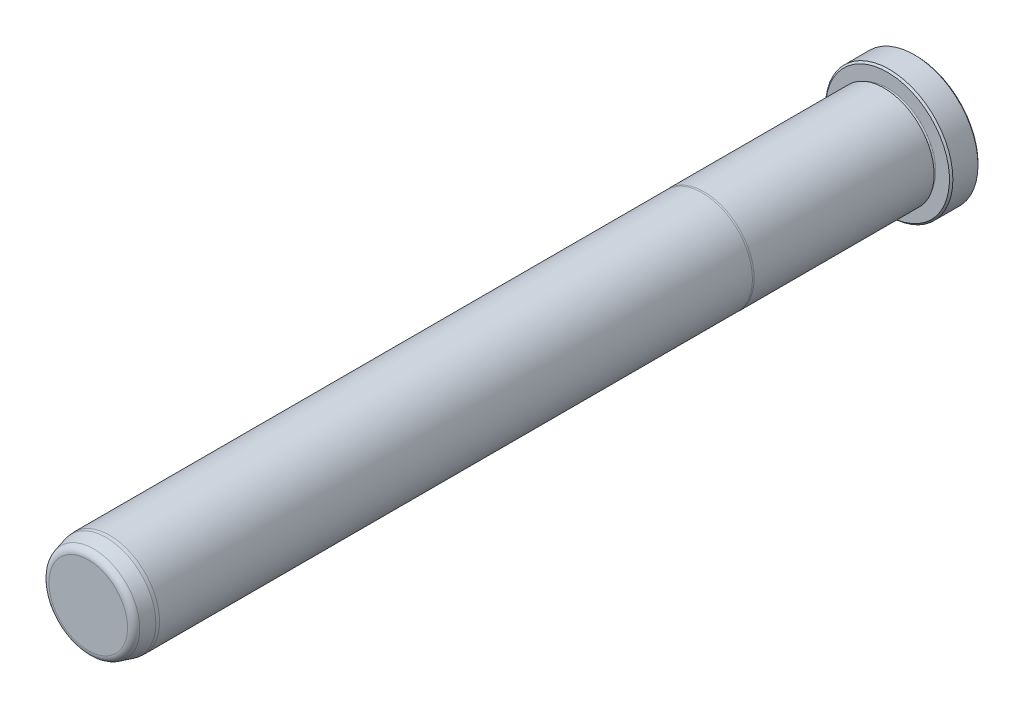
from build123d import *

# Parameters (mm, degrees)
FILLET6_R     = 1.5875
CHAMFER1_SIZE = 0.381


with BuildPart() as part:
    # Sketch1 → Revolve1 (revolve)
    with BuildSketch(Plane(origin=(0, 0, 0), x_dir=(0, 0, -1), z_dir=(1, 0, 0)), mode=Mode.PRIVATE) as revolve1_sk:
        with BuildLine():
            Line((0, 0), (0, 14.1605))
            Line((0, 14.1605), (-6.35, 14.1605))
            Line((-6.35, 14.1605), (-6.35, 10.7188))
            ThreePointArc((-6.35, 10.7188), (-6.731, 10.3378), (-7.112, 10.7188))
            Line((-7.112, 10.7188), (-7.112, 11.1252))
            Line((-7.112, 11.1252), (-47.134763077, 11.1252))
            Line((-47.134763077, 11.1252), (-47.498, 11.0998))
            Line((-47.498, 11.0998), (-179.3875, 11.0998))
            Line((-179.3875, 11.0998), (-180.1495, 11.033133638))
            Line((-180.1495, 11.033133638), (-184.15, 9.961202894))
            Line((-184.15, 9.961202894), (-184.15, 0))
            Line((-184.15, 0), (0, 0))
        make_face()
    revolve(revolve1_sk.sketch.rotate(Axis((0, 0, 0), (0, 0, -1)), 90), axis=Axis((0, 0, 0), (0, 0, -1)))

    # Fillet6
    fillet6_edges = [part.edges().sort_by_distance(p)[0] for p in [
        (-9.961202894, 0, 184.15),
    ]]
    fillet(fillet6_edges, radius=FILLET6_R)

    # Chamfer1
    chamfer1_edges = [part.edges().sort_by_distance(p)[0] for p in [
        (-14.1605, 0, 6.35),
        (-14.1605, 0, 0),
    ]]
    chamfer(chamfer1_edges, length=CHAMFER1_SIZE)


solid = part.part
